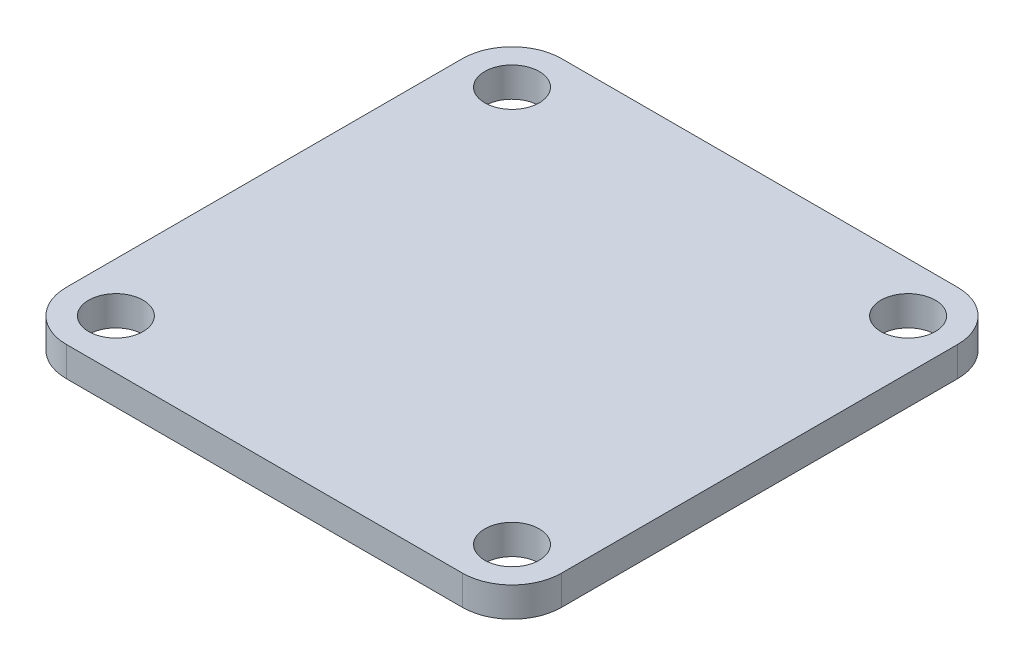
ISO-10303-21;
HEADER;
FILE_DESCRIPTION(('STEP AP214'),'2;1');
FILE_NAME('part.step','',(''),(''),'','','');
FILE_SCHEMA(('AUTOMOTIVE_DESIGN { 1 0 10303 214 1 1 1 1 }'));
ENDSEC;
DATA;
#1=APPLICATION_CONTEXT('core data for automotive mechanical design processes');
#2=APPLICATION_PROTOCOL_DEFINITION('international standard','automotive_design',2000,#1);
#3=PRODUCT_CONTEXT('',#1,'mechanical');
#4=PRODUCT('Part','Part','',(#3));
#5=PRODUCT_RELATED_PRODUCT_CATEGORY('part','',(#4));
#6=PRODUCT_DEFINITION_FORMATION('','',#4);
#7=PRODUCT_DEFINITION_CONTEXT('part definition',#1,'design');
#8=PRODUCT_DEFINITION('design','',#6,#7);
#9=PRODUCT_DEFINITION_SHAPE('','',#8);
#10=(LENGTH_UNIT() NAMED_UNIT(*) SI_UNIT(.MILLI.,.METRE.));
#11=(NAMED_UNIT(*) PLANE_ANGLE_UNIT() SI_UNIT($,.RADIAN.));
#12=(NAMED_UNIT(*) SI_UNIT($,.STERADIAN.) SOLID_ANGLE_UNIT());
#13=UNCERTAINTY_MEASURE_WITH_UNIT(LENGTH_MEASURE(1.E-05),#10,'distance_accuracy_value','');
#14=(GEOMETRIC_REPRESENTATION_CONTEXT(3) GLOBAL_UNCERTAINTY_ASSIGNED_CONTEXT((#13)) GLOBAL_UNIT_ASSIGNED_CONTEXT((#10,
#11,#12)) REPRESENTATION_CONTEXT('',''));
#15=CARTESIAN_POINT('',(0.,0.,0.));
#16=DIRECTION('',(0.,0.,1.));
#17=DIRECTION('',(1.,0.,0.));
#18=AXIS2_PLACEMENT_3D('',#15,#16,#17);
#19=CARTESIAN_POINT('',(-20.,3.,20.));
#20=DIRECTION('',(0.,1.,0.));
#21=DIRECTION('',(0.,0.,1.));
#22=AXIS2_PLACEMENT_3D('',#19,#20,#21);
#23=PLANE('',#22);
#24=CARTESIAN_POINT('',(-20.,3.,20.));
#25=DIRECTION('',(0.,1.,0.));
#26=DIRECTION('',(0.,0.,1.));
#27=AXIS2_PLACEMENT_3D('',#24,#25,#26);
#28=CIRCLE('',#27,2.75);
#29=CARTESIAN_POINT('',(-20.,3.,22.75));
#30=VERTEX_POINT('',#29);
#31=EDGE_CURVE('E224',#30,#30,#28,.T.);
#32=ORIENTED_EDGE('',*,*,#31,.F.);
#33=EDGE_LOOP('',(#32));
#34=FACE_BOUND('',#33,.T.);
#35=CARTESIAN_POINT('',(-20.,3.,-20.));
#36=DIRECTION('',(0.,1.,0.));
#37=DIRECTION('',(0.,0.,1.));
#38=AXIS2_PLACEMENT_3D('',#35,#36,#37);
#39=CIRCLE('',#38,2.75);
#40=CARTESIAN_POINT('',(-20.,3.,-17.25));
#41=VERTEX_POINT('',#40);
#42=EDGE_CURVE('E148',#41,#41,#39,.T.);
#43=ORIENTED_EDGE('',*,*,#42,.F.);
#44=EDGE_LOOP('',(#43));
#45=FACE_BOUND('',#44,.T.);
#46=CARTESIAN_POINT('',(-20.,3.,20.));
#47=DIRECTION('',(0.,1.,0.));
#48=DIRECTION('',(0.,0.,1.));
#49=AXIS2_PLACEMENT_3D('',#46,#47,#48);
#50=CIRCLE('',#49,5.);
#51=CARTESIAN_POINT('',(-25.,3.,20.));
#52=VERTEX_POINT('',#51);
#53=CARTESIAN_POINT('',(-20.,3.,25.));
#54=VERTEX_POINT('',#53);
#55=EDGE_CURVE('E166',#52,#54,#50,.T.);
#56=ORIENTED_EDGE('',*,*,#55,.T.);
#57=DIRECTION('',(1.,0.,0.));
#58=VECTOR('',#57,1.);
#59=CARTESIAN_POINT('',(-20.,3.,25.));
#60=LINE('',#59,#58);
#61=CARTESIAN_POINT('',(20.,3.,25.));
#62=VERTEX_POINT('',#61);
#63=EDGE_CURVE('E100',#54,#62,#60,.T.);
#64=ORIENTED_EDGE('',*,*,#63,.T.);
#65=CARTESIAN_POINT('',(20.,3.,20.));
#66=DIRECTION('',(0.,1.,0.));
#67=DIRECTION('',(0.,0.,1.));
#68=AXIS2_PLACEMENT_3D('',#65,#66,#67);
#69=CIRCLE('',#68,5.);
#70=CARTESIAN_POINT('',(25.,3.,20.));
#71=VERTEX_POINT('',#70);
#72=EDGE_CURVE('E188',#62,#71,#69,.T.);
#73=ORIENTED_EDGE('',*,*,#72,.T.);
#74=DIRECTION('',(0.,0.,-1.));
#75=VECTOR('',#74,1.);
#76=CARTESIAN_POINT('',(25.,3.,-20.));
#77=LINE('',#76,#75);
#78=CARTESIAN_POINT('',(25.,3.,-20.));
#79=VERTEX_POINT('',#78);
#80=EDGE_CURVE('E202',#71,#79,#77,.T.);
#81=ORIENTED_EDGE('',*,*,#80,.T.);
#82=CARTESIAN_POINT('',(20.,3.,-20.));
#83=DIRECTION('',(0.,1.,0.));
#84=DIRECTION('',(0.,0.,1.));
#85=AXIS2_PLACEMENT_3D('',#82,#83,#84);
#86=CIRCLE('',#85,5.);
#87=CARTESIAN_POINT('',(20.,3.,-25.));
#88=VERTEX_POINT('',#87);
#89=EDGE_CURVE('E119',#79,#88,#86,.T.);
#90=ORIENTED_EDGE('',*,*,#89,.T.);
#91=DIRECTION('',(-1.,0.,0.));
#92=VECTOR('',#91,1.);
#93=CARTESIAN_POINT('',(-20.,3.,-25.));
#94=LINE('',#93,#92);
#95=CARTESIAN_POINT('',(-20.,3.,-25.));
#96=VERTEX_POINT('',#95);
#97=EDGE_CURVE('E113',#88,#96,#94,.T.);
#98=ORIENTED_EDGE('',*,*,#97,.T.);
#99=CARTESIAN_POINT('',(-20.,3.,-20.));
#100=DIRECTION('',(0.,1.,0.));
#101=DIRECTION('',(0.,0.,1.));
#102=AXIS2_PLACEMENT_3D('',#99,#100,#101);
#103=CIRCLE('',#102,5.);
#104=CARTESIAN_POINT('',(-25.,3.,-20.));
#105=VERTEX_POINT('',#104);
#106=EDGE_CURVE('E117',#96,#105,#103,.T.);
#107=ORIENTED_EDGE('',*,*,#106,.T.);
#108=DIRECTION('',(0.,0.,1.));
#109=VECTOR('',#108,1.);
#110=CARTESIAN_POINT('',(-25.,3.,-20.));
#111=LINE('',#110,#109);
#112=EDGE_CURVE('E57',#105,#52,#111,.T.);
#113=ORIENTED_EDGE('',*,*,#112,.T.);
#114=EDGE_LOOP('',(#56,#64,#73,#81,#90,#98,#107,#113));
#115=FACE_BOUND('',#114,.T.);
#116=CARTESIAN_POINT('',(20.,3.,-20.));
#117=DIRECTION('',(0.,1.,0.));
#118=DIRECTION('',(0.,0.,1.));
#119=AXIS2_PLACEMENT_3D('',#116,#117,#118);
#120=CIRCLE('',#119,2.75);
#121=CARTESIAN_POINT('',(20.,3.,-17.25));
#122=VERTEX_POINT('',#121);
#123=EDGE_CURVE('E217',#122,#122,#120,.T.);
#124=ORIENTED_EDGE('',*,*,#123,.F.);
#125=EDGE_LOOP('',(#124));
#126=FACE_BOUND('',#125,.T.);
#127=CARTESIAN_POINT('',(20.,3.,20.));
#128=DIRECTION('',(0.,1.,0.));
#129=DIRECTION('',(0.,0.,1.));
#130=AXIS2_PLACEMENT_3D('',#127,#128,#129);
#131=CIRCLE('',#130,2.75);
#132=CARTESIAN_POINT('',(20.,3.,22.75));
#133=VERTEX_POINT('',#132);
#134=EDGE_CURVE('E230',#133,#133,#131,.T.);
#135=ORIENTED_EDGE('',*,*,#134,.F.);
#136=EDGE_LOOP('',(#135));
#137=FACE_BOUND('',#136,.T.);
#138=ADVANCED_FACE('F39',(#34,#45,#115,#126,#137),#23,.T.);
#139=CARTESIAN_POINT('',(-20.,0.,20.));
#140=DIRECTION('',(0.,1.,0.));
#141=DIRECTION('',(0.,0.,1.));
#142=AXIS2_PLACEMENT_3D('',#139,#140,#141);
#143=PLANE('',#142);
#144=CARTESIAN_POINT('',(-20.,0.,20.));
#145=DIRECTION('',(0.,1.,0.));
#146=DIRECTION('',(0.,0.,1.));
#147=AXIS2_PLACEMENT_3D('',#144,#145,#146);
#148=CIRCLE('',#147,5.);
#149=CARTESIAN_POINT('',(-25.,0.,20.));
#150=VERTEX_POINT('',#149);
#151=CARTESIAN_POINT('',(-20.,0.,25.));
#152=VERTEX_POINT('',#151);
#153=EDGE_CURVE('E143',#150,#152,#148,.T.);
#154=ORIENTED_EDGE('',*,*,#153,.F.);
#155=DIRECTION('',(0.,0.,1.));
#156=VECTOR('',#155,1.);
#157=CARTESIAN_POINT('',(-25.,0.,-20.));
#158=LINE('',#157,#156);
#159=CARTESIAN_POINT('',(-25.,0.,-20.));
#160=VERTEX_POINT('',#159);
#161=EDGE_CURVE('E92',#160,#150,#158,.T.);
#162=ORIENTED_EDGE('',*,*,#161,.F.);
#163=CARTESIAN_POINT('',(-20.,0.,-20.));
#164=DIRECTION('',(0.,1.,0.));
#165=DIRECTION('',(0.,0.,1.));
#166=AXIS2_PLACEMENT_3D('',#163,#164,#165);
#167=CIRCLE('',#166,5.);
#168=CARTESIAN_POINT('',(-20.,0.,-25.));
#169=VERTEX_POINT('',#168);
#170=EDGE_CURVE('E86',#169,#160,#167,.T.);
#171=ORIENTED_EDGE('',*,*,#170,.F.);
#172=DIRECTION('',(-1.,0.,0.));
#173=VECTOR('',#172,1.);
#174=CARTESIAN_POINT('',(-20.,0.,-25.));
#175=LINE('',#174,#173);
#176=CARTESIAN_POINT('',(20.,0.,-25.));
#177=VERTEX_POINT('',#176);
#178=EDGE_CURVE('E128',#177,#169,#175,.T.);
#179=ORIENTED_EDGE('',*,*,#178,.F.);
#180=CARTESIAN_POINT('',(20.,0.,-20.));
#181=DIRECTION('',(0.,1.,0.));
#182=DIRECTION('',(0.,0.,1.));
#183=AXIS2_PLACEMENT_3D('',#180,#181,#182);
#184=CIRCLE('',#183,5.);
#185=CARTESIAN_POINT('',(25.,0.,-20.));
#186=VERTEX_POINT('',#185);
#187=EDGE_CURVE('E157',#186,#177,#184,.T.);
#188=ORIENTED_EDGE('',*,*,#187,.F.);
#189=DIRECTION('',(0.,0.,-1.));
#190=VECTOR('',#189,1.);
#191=CARTESIAN_POINT('',(25.,0.,-20.));
#192=LINE('',#191,#190);
#193=CARTESIAN_POINT('',(25.,0.,20.));
#194=VERTEX_POINT('',#193);
#195=EDGE_CURVE('E154',#194,#186,#192,.T.);
#196=ORIENTED_EDGE('',*,*,#195,.F.);
#197=CARTESIAN_POINT('',(20.,0.,20.));
#198=DIRECTION('',(0.,1.,0.));
#199=DIRECTION('',(0.,0.,1.));
#200=AXIS2_PLACEMENT_3D('',#197,#198,#199);
#201=CIRCLE('',#200,5.);
#202=CARTESIAN_POINT('',(20.,0.,25.));
#203=VERTEX_POINT('',#202);
#204=EDGE_CURVE('E151',#203,#194,#201,.T.);
#205=ORIENTED_EDGE('',*,*,#204,.F.);
#206=DIRECTION('',(1.,0.,0.));
#207=VECTOR('',#206,1.);
#208=CARTESIAN_POINT('',(-20.,0.,25.));
#209=LINE('',#208,#207);
#210=EDGE_CURVE('E147',#152,#203,#209,.T.);
#211=ORIENTED_EDGE('',*,*,#210,.F.);
#212=EDGE_LOOP('',(#154,#162,#171,#179,#188,#196,#205,#211));
#213=FACE_BOUND('',#212,.T.);
#214=CARTESIAN_POINT('',(-20.,0.,-20.));
#215=DIRECTION('',(0.,1.,0.));
#216=DIRECTION('',(0.,0.,1.));
#217=AXIS2_PLACEMENT_3D('',#214,#215,#216);
#218=CIRCLE('',#217,2.75);
#219=CARTESIAN_POINT('',(-20.,0.,-17.25));
#220=VERTEX_POINT('',#219);
#221=EDGE_CURVE('E213',#220,#220,#218,.T.);
#222=ORIENTED_EDGE('',*,*,#221,.T.);
#223=EDGE_LOOP('',(#222));
#224=FACE_BOUND('',#223,.T.);
#225=CARTESIAN_POINT('',(20.,0.,-20.));
#226=DIRECTION('',(0.,1.,0.));
#227=DIRECTION('',(0.,0.,1.));
#228=AXIS2_PLACEMENT_3D('',#225,#226,#227);
#229=CIRCLE('',#228,2.75);
#230=CARTESIAN_POINT('',(20.,0.,-17.25));
#231=VERTEX_POINT('',#230);
#232=EDGE_CURVE('E220',#231,#231,#229,.T.);
#233=ORIENTED_EDGE('',*,*,#232,.T.);
#234=EDGE_LOOP('',(#233));
#235=FACE_BOUND('',#234,.T.);
#236=CARTESIAN_POINT('',(-20.,0.,20.));
#237=DIRECTION('',(0.,1.,0.));
#238=DIRECTION('',(0.,0.,1.));
#239=AXIS2_PLACEMENT_3D('',#236,#237,#238);
#240=CIRCLE('',#239,2.75);
#241=CARTESIAN_POINT('',(-20.,0.,22.75));
#242=VERTEX_POINT('',#241);
#243=EDGE_CURVE('E227',#242,#242,#240,.T.);
#244=ORIENTED_EDGE('',*,*,#243,.T.);
#245=EDGE_LOOP('',(#244));
#246=FACE_BOUND('',#245,.T.);
#247=CARTESIAN_POINT('',(20.,0.,20.));
#248=DIRECTION('',(0.,1.,0.));
#249=DIRECTION('',(0.,0.,1.));
#250=AXIS2_PLACEMENT_3D('',#247,#248,#249);
#251=CIRCLE('',#250,2.75);
#252=CARTESIAN_POINT('',(20.,0.,22.75));
#253=VERTEX_POINT('',#252);
#254=EDGE_CURVE('E234',#253,#253,#251,.T.);
#255=ORIENTED_EDGE('',*,*,#254,.T.);
#256=EDGE_LOOP('',(#255));
#257=FACE_BOUND('',#256,.T.);
#258=ADVANCED_FACE('F192',(#213,#224,#235,#246,#257),#143,.F.);
#259=CARTESIAN_POINT('',(-20.,3.,20.));
#260=DIRECTION('',(0.,-1.,0.));
#261=DIRECTION('',(0.,0.,-1.));
#262=AXIS2_PLACEMENT_3D('',#259,#260,#261);
#263=CYLINDRICAL_SURFACE('',#262,5.);
#264=ORIENTED_EDGE('',*,*,#153,.T.);
#265=DIRECTION('',(0.,-1.,0.));
#266=VECTOR('',#265,1.);
#267=CARTESIAN_POINT('',(-20.,3.,25.));
#268=LINE('',#267,#266);
#269=EDGE_CURVE('E11',#54,#152,#268,.T.);
#270=ORIENTED_EDGE('',*,*,#269,.F.);
#271=ORIENTED_EDGE('',*,*,#55,.F.);
#272=DIRECTION('',(0.,-1.,0.));
#273=VECTOR('',#272,1.);
#274=CARTESIAN_POINT('',(-25.,3.,20.));
#275=LINE('',#274,#273);
#276=EDGE_CURVE('E139',#52,#150,#275,.T.);
#277=ORIENTED_EDGE('',*,*,#276,.T.);
#278=EDGE_LOOP('',(#264,#270,#271,#277));
#279=FACE_BOUND('',#278,.T.);
#280=ADVANCED_FACE('F41',(#279),#263,.T.);
#281=CARTESIAN_POINT('',(-20.,3.,25.));
#282=DIRECTION('',(0.,0.,-1.));
#283=DIRECTION('',(-1.,0.,0.));
#284=AXIS2_PLACEMENT_3D('',#281,#282,#283);
#285=PLANE('',#284);
#286=ORIENTED_EDGE('',*,*,#210,.T.);
#287=DIRECTION('',(0.,-1.,0.));
#288=VECTOR('',#287,1.);
#289=CARTESIAN_POINT('',(20.,3.,25.));
#290=LINE('',#289,#288);
#291=EDGE_CURVE('E49',#62,#203,#290,.T.);
#292=ORIENTED_EDGE('',*,*,#291,.F.);
#293=ORIENTED_EDGE('',*,*,#63,.F.);
#294=ORIENTED_EDGE('',*,*,#269,.T.);
#295=EDGE_LOOP('',(#286,#292,#293,#294));
#296=FACE_BOUND('',#295,.T.);
#297=ADVANCED_FACE('F269',(#296),#285,.F.);
#298=CARTESIAN_POINT('',(20.,3.,20.));
#299=DIRECTION('',(0.,-1.,0.));
#300=DIRECTION('',(0.,0.,-1.));
#301=AXIS2_PLACEMENT_3D('',#298,#299,#300);
#302=CYLINDRICAL_SURFACE('',#301,5.);
#303=ORIENTED_EDGE('',*,*,#204,.T.);
#304=DIRECTION('',(0.,-1.,0.));
#305=VECTOR('',#304,1.);
#306=CARTESIAN_POINT('',(25.,3.,20.));
#307=LINE('',#306,#305);
#308=EDGE_CURVE('E176',#71,#194,#307,.T.);
#309=ORIENTED_EDGE('',*,*,#308,.F.);
#310=ORIENTED_EDGE('',*,*,#72,.F.);
#311=ORIENTED_EDGE('',*,*,#291,.T.);
#312=EDGE_LOOP('',(#303,#309,#310,#311));
#313=FACE_BOUND('',#312,.T.);
#314=ADVANCED_FACE('F186',(#313),#302,.T.);
#315=CARTESIAN_POINT('',(25.,3.,-20.));
#316=DIRECTION('',(-1.,0.,0.));
#317=DIRECTION('',(0.,0.,1.));
#318=AXIS2_PLACEMENT_3D('',#315,#316,#317);
#319=PLANE('',#318);
#320=ORIENTED_EDGE('',*,*,#195,.T.);
#321=DIRECTION('',(0.,-1.,0.));
#322=VECTOR('',#321,1.);
#323=CARTESIAN_POINT('',(25.,3.,-20.));
#324=LINE('',#323,#322);
#325=EDGE_CURVE('E172',#79,#186,#324,.T.);
#326=ORIENTED_EDGE('',*,*,#325,.F.);
#327=ORIENTED_EDGE('',*,*,#80,.F.);
#328=ORIENTED_EDGE('',*,*,#308,.T.);
#329=EDGE_LOOP('',(#320,#326,#327,#328));
#330=FACE_BOUND('',#329,.T.);
#331=ADVANCED_FACE('F197',(#330),#319,.F.);
#332=CARTESIAN_POINT('',(20.,3.,-20.));
#333=DIRECTION('',(0.,-1.,0.));
#334=DIRECTION('',(0.,0.,-1.));
#335=AXIS2_PLACEMENT_3D('',#332,#333,#334);
#336=CYLINDRICAL_SURFACE('',#335,5.);
#337=ORIENTED_EDGE('',*,*,#187,.T.);
#338=DIRECTION('',(0.,-1.,0.));
#339=VECTOR('',#338,1.);
#340=CARTESIAN_POINT('',(20.,3.,-25.));
#341=LINE('',#340,#339);
#342=EDGE_CURVE('E130',#88,#177,#341,.T.);
#343=ORIENTED_EDGE('',*,*,#342,.F.);
#344=ORIENTED_EDGE('',*,*,#89,.F.);
#345=ORIENTED_EDGE('',*,*,#325,.T.);
#346=EDGE_LOOP('',(#337,#343,#344,#345));
#347=FACE_BOUND('',#346,.T.);
#348=ADVANCED_FACE('F200',(#347),#336,.T.);
#349=CARTESIAN_POINT('',(-20.,3.,-25.));
#350=DIRECTION('',(0.,0.,1.));
#351=DIRECTION('',(1.,0.,0.));
#352=AXIS2_PLACEMENT_3D('',#349,#350,#351);
#353=PLANE('',#352);
#354=ORIENTED_EDGE('',*,*,#178,.T.);
#355=DIRECTION('',(0.,-1.,0.));
#356=VECTOR('',#355,1.);
#357=CARTESIAN_POINT('',(-20.,3.,-25.));
#358=LINE('',#357,#356);
#359=EDGE_CURVE('E125',#96,#169,#358,.T.);
#360=ORIENTED_EDGE('',*,*,#359,.F.);
#361=ORIENTED_EDGE('',*,*,#97,.F.);
#362=ORIENTED_EDGE('',*,*,#342,.T.);
#363=EDGE_LOOP('',(#354,#360,#361,#362));
#364=FACE_BOUND('',#363,.T.);
#365=ADVANCED_FACE('F126',(#364),#353,.F.);
#366=CARTESIAN_POINT('',(-20.,3.,-20.));
#367=DIRECTION('',(0.,-1.,0.));
#368=DIRECTION('',(0.,0.,-1.));
#369=AXIS2_PLACEMENT_3D('',#366,#367,#368);
#370=CYLINDRICAL_SURFACE('',#369,5.);
#371=ORIENTED_EDGE('',*,*,#170,.T.);
#372=DIRECTION('',(0.,-1.,0.));
#373=VECTOR('',#372,1.);
#374=CARTESIAN_POINT('',(-25.,3.,-20.));
#375=LINE('',#374,#373);
#376=EDGE_CURVE('E131',#105,#160,#375,.T.);
#377=ORIENTED_EDGE('',*,*,#376,.F.);
#378=ORIENTED_EDGE('',*,*,#106,.F.);
#379=ORIENTED_EDGE('',*,*,#359,.T.);
#380=EDGE_LOOP('',(#371,#377,#378,#379));
#381=FACE_BOUND('',#380,.T.);
#382=ADVANCED_FACE('F133',(#381),#370,.T.);
#383=CARTESIAN_POINT('',(-25.,3.,-20.));
#384=DIRECTION('',(1.,0.,0.));
#385=DIRECTION('',(0.,0.,-1.));
#386=AXIS2_PLACEMENT_3D('',#383,#384,#385);
#387=PLANE('',#386);
#388=ORIENTED_EDGE('',*,*,#161,.T.);
#389=ORIENTED_EDGE('',*,*,#276,.F.);
#390=ORIENTED_EDGE('',*,*,#112,.F.);
#391=ORIENTED_EDGE('',*,*,#376,.T.);
#392=EDGE_LOOP('',(#388,#389,#390,#391));
#393=FACE_BOUND('',#392,.T.);
#394=ADVANCED_FACE('F257',(#393),#387,.F.);
#395=CARTESIAN_POINT('',(-20.,3.,-20.));
#396=DIRECTION('',(0.,-1.,0.));
#397=DIRECTION('',(0.,0.,-1.));
#398=AXIS2_PLACEMENT_3D('',#395,#396,#397);
#399=CYLINDRICAL_SURFACE('',#398,2.75);
#400=ORIENTED_EDGE('',*,*,#42,.T.);
#401=EDGE_LOOP('',(#400));
#402=FACE_BOUND('',#401,.T.);
#403=ORIENTED_EDGE('',*,*,#221,.F.);
#404=EDGE_LOOP('',(#403));
#405=FACE_BOUND('',#404,.T.);
#406=ADVANCED_FACE('F254',(#402,#405),#399,.F.);
#407=CARTESIAN_POINT('',(20.,3.,-20.));
#408=DIRECTION('',(0.,-1.,0.));
#409=DIRECTION('',(0.,0.,-1.));
#410=AXIS2_PLACEMENT_3D('',#407,#408,#409);
#411=CYLINDRICAL_SURFACE('',#410,2.75);
#412=ORIENTED_EDGE('',*,*,#123,.T.);
#413=EDGE_LOOP('',(#412));
#414=FACE_BOUND('',#413,.T.);
#415=ORIENTED_EDGE('',*,*,#232,.F.);
#416=EDGE_LOOP('',(#415));
#417=FACE_BOUND('',#416,.T.);
#418=ADVANCED_FACE('F343',(#414,#417),#411,.F.);
#419=CARTESIAN_POINT('',(-20.,3.,20.));
#420=DIRECTION('',(0.,-1.,0.));
#421=DIRECTION('',(0.,0.,-1.));
#422=AXIS2_PLACEMENT_3D('',#419,#420,#421);
#423=CYLINDRICAL_SURFACE('',#422,2.75);
#424=ORIENTED_EDGE('',*,*,#31,.T.);
#425=EDGE_LOOP('',(#424));
#426=FACE_BOUND('',#425,.T.);
#427=ORIENTED_EDGE('',*,*,#243,.F.);
#428=EDGE_LOOP('',(#427));
#429=FACE_BOUND('',#428,.T.);
#430=ADVANCED_FACE('F352',(#426,#429),#423,.F.);
#431=CARTESIAN_POINT('',(20.,3.,20.));
#432=DIRECTION('',(0.,-1.,0.));
#433=DIRECTION('',(0.,0.,-1.));
#434=AXIS2_PLACEMENT_3D('',#431,#432,#433);
#435=CYLINDRICAL_SURFACE('',#434,2.75);
#436=ORIENTED_EDGE('',*,*,#134,.T.);
#437=EDGE_LOOP('',(#436));
#438=FACE_BOUND('',#437,.T.);
#439=ORIENTED_EDGE('',*,*,#254,.F.);
#440=EDGE_LOOP('',(#439));
#441=FACE_BOUND('',#440,.T.);
#442=ADVANCED_FACE('F241',(#438,#441),#435,.F.);
#443=CLOSED_SHELL('',(#138,#258,#280,#297,#314,#331,#348,#365,#382,#394,#406,#418,#430,#442));
#444=MANIFOLD_SOLID_BREP('B2',#443);
#445=ADVANCED_BREP_SHAPE_REPRESENTATION('',(#18,#444),#14);
#446=SHAPE_DEFINITION_REPRESENTATION(#9,#445);
ENDSEC;
END-ISO-10303-21;
